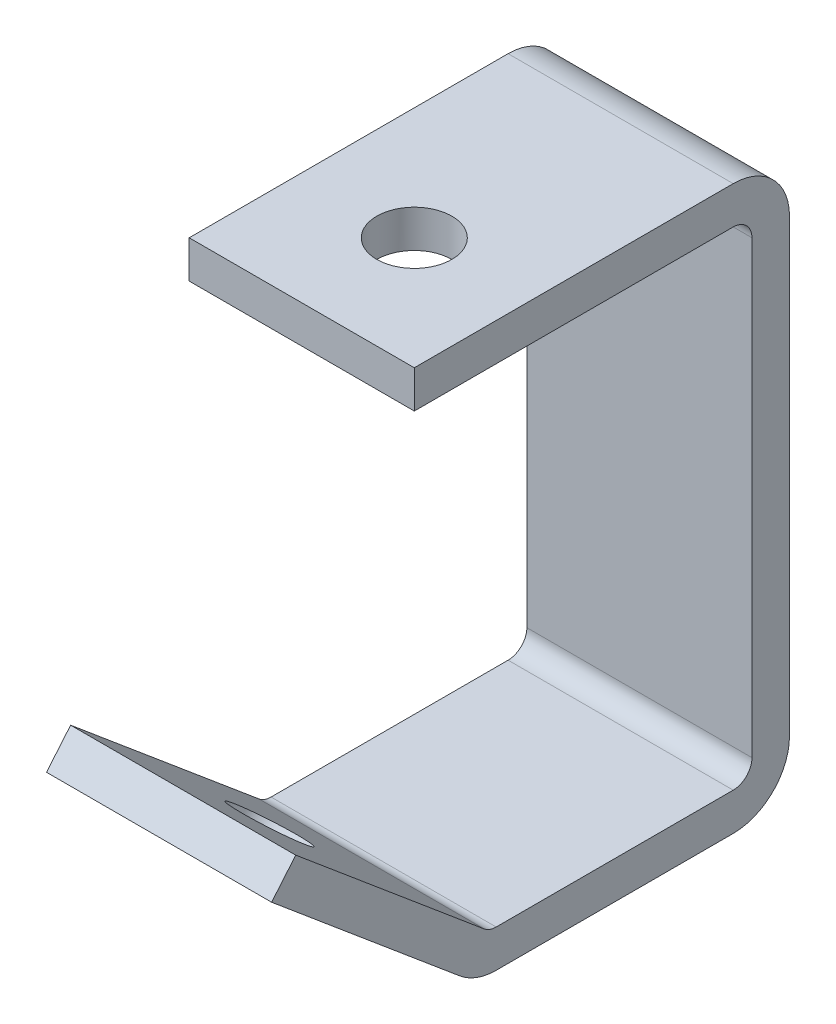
from build123d import *

# Parameters (mm, degrees)
BASE_EXTRUDE_THIN_DEPTH = 19.05
CUT_EXTRUDE1_REACH      = 128.668
SKETCH2_R               = 6.35
CUT_EXTRUDE2_REACH      = 133.155
SKETCH3_R               = 6


with BuildPart() as part:
    # Sketch1 → Base-Extrude-Thin (new, symmetric)
    with BuildSketch(Plane(origin=(0, 0, 0), x_dir=(0, 0, -1), z_dir=(1, 0, 0))):
        with BuildLine():
            Line((-77.216478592, 27.494340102), (-45.335245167, 0.742808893))
            ThreePointArc((-45.335245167, 0.742808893), (-44.380308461, 0.191475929), (-43.294394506, 0))
            Line((-43.294394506, 0), (-3.175, 0))
            ThreePointArc((-3.175, 0), (-0.92993597, 0.92993597), (0, 3.175))
            Line((0, 3.175), (0, 79.375))
            ThreePointArc((0, 79.375), (-0.92993597, 81.62006403), (-3.175, 82.55))
            Line((-3.175, 82.55), (-57.15, 82.55))
            Line((-57.15, 82.55), (-57.15, 88.9))
            Line((-57.15, 88.9), (-3.175, 88.9))
            ThreePointArc((-3.175, 88.9), (3.560192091, 86.110192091), (6.35, 79.375))
            Line((6.35, 79.375), (6.35, 3.175))
            ThreePointArc((6.35, 3.175), (3.560192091, -3.560192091), (-3.175, -6.35))
            Line((-3.175, -6.35), (-43.294394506, -6.35))
            ThreePointArc((-43.294394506, -6.35), (-46.552136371, -5.775572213), (-49.416946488, -4.121573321))
            Line((-49.416946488, -4.121573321), (-81.298179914, 22.629957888))
            Line((-81.298179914, 22.629957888), (-77.216478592, 27.494340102))
        make_face()
    extrude(amount=BASE_EXTRUDE_THIN_DEPTH, both=True)

    # Sketch2 → Cut-Extrude1 (cut, up to next)
    with BuildSketch(Plane(origin=(0, 88.9, 0), x_dir=(-1, 0, 0), z_dir=(0, 1, 0)), mode=Mode.PRIVATE) as cut_extrude1_sk1:
        with Locations(Location((0, 38.1, 0), (0, 0, 90))):
            Circle(SKETCH2_R)
    cut_extrude1_tool1 = extrude(cut_extrude1_sk1.sketch, amount=-CUT_EXTRUDE1_REACH, mode=Mode.PRIVATE) & part.part
    add(cut_extrude1_tool1.solids().sort_by_distance((0, 88.9, 38.1))[0], mode=Mode.SUBTRACT)

    # Sketch3 → Cut-Extrude2 (cut, up to next)
    with BuildSketch(Plane(origin=(0, -26.751734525, 22.447370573), x_dir=(1, 0, 0), z_dir=(0, -0.7660444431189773, 0.6427876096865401)), mode=Mode.PRIVATE) as cut_extrude2_sk1:
        with Locations(Location((0, 57.758202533, 0), (0, 0, 270))):
            Circle(SKETCH3_R)
    cut_extrude2_tool1 = extrude(cut_extrude2_sk1.sketch, amount=-CUT_EXTRUDE2_REACH, mode=Mode.PRIVATE) & part.part
    add(cut_extrude2_tool1.solids().sort_by_distance((0, 10.374522, 66.692721))[0], mode=Mode.SUBTRACT)


solid = part.part
